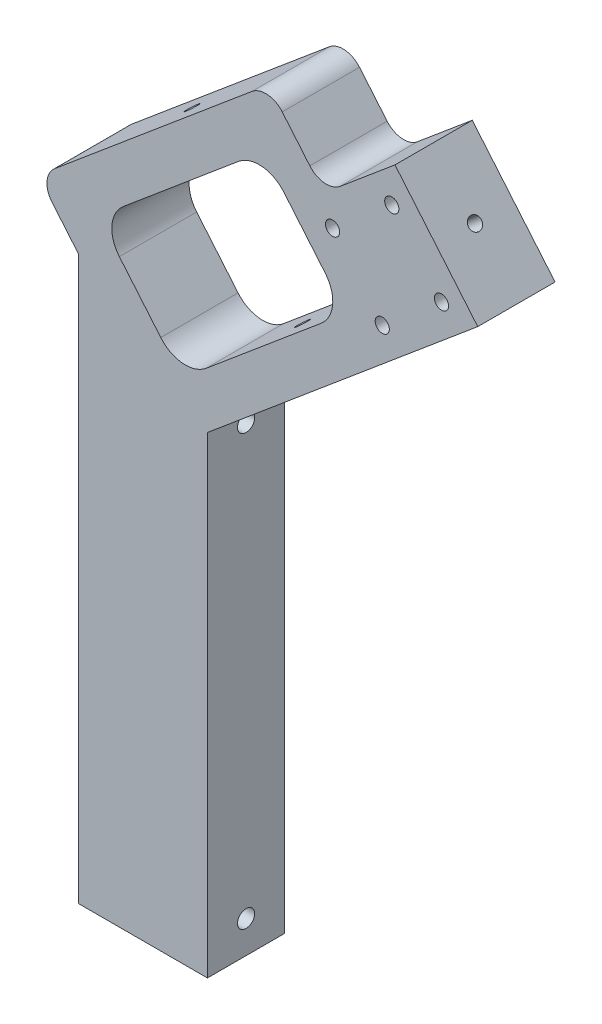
from build123d import *

# Parameters (mm, degrees)
ESQUISSE1_R                  = 3.3
BOSS_EXTRU_1_DEPTH           = 18
ENL_V_MAT_EXTRU_1_DEPTH      = 265.286467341
ENL_V_MAT_EXTRU_1_DEPTH_BACK = 265.286467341
ESQUISSE2_R                  = 4
ENL_V_MAT_EXTRU_2_DEPTH      = 271.104745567
ENL_V_MAT_EXTRU_2_DEPTH_BACK = 271.104745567
ESQUISSE3_R                  = 3
ESQUISSE4_R                  = 3
ENL_V_MAT_EXTRU_3_DEPTH      = 100


with BuildPart() as part:
    # Esquisse1 → Boss.-Extru.1 (new, symmetric)
    with BuildSketch(Plane.XY):
        with BuildLine():
            Line((-74.959861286, -139.936063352), (-74.959861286, 122.010399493))
            Line((-74.959861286, 122.010399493), (-87.365590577, 136.794971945))
            ThreePointArc((-87.365590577, 136.794971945), (-89.667093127, 144.094405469), (-86.133022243, 150.883292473))
            Line((-86.133022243, 150.883292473), (5.792310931, 228.017805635))
            ThreePointArc((5.792310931, 228.017805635), (13.091744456, 230.319308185), (19.880631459, 226.785237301))
            Line((19.880631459, 226.785237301), (32.736383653, 211.464348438))
            ThreePointArc((32.736383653, 211.464348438), (39.525270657, 207.930277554), (46.824704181, 210.231780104))
            Line((46.824704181, 210.231780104), (72.375827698, 231.671718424))
            Line((72.375827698, 231.671718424), (110.94308428, 185.709051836))
            Line((110.94308428, 185.709051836), (-14.959861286, 80.063936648))
            Line((-14.959861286, 80.063936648), (-14.959861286, -139.936063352))
            Line((-14.959861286, -139.936063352), (-74.959861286, -139.936063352))
        make_face()
        with Locations((43.319145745, 191.625379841)):
            Circle(ESQUISSE1_R, mode=Mode.SUBTRACT)
        with Locations((70.896745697, 214.76573379)):
            Circle(ESQUISSE1_R, mode=Mode.SUBTRACT)
        with Locations((94.037099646, 187.188133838)):
            Circle(ESQUISSE1_R, mode=Mode.SUBTRACT)
        with Locations((66.459499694, 164.047779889)):
            Circle(ESQUISSE1_R, mode=Mode.SUBTRACT)
        with BuildLine():
            Line((-15.55890239, 105.669427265), (38.064208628, 150.664559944))
            ThreePointArc((38.064208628, 150.664559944), (43.365314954, 160.847890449), (39.91306113, 171.797040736))
            Line((39.91306113, 171.797040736), (20.629432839, 194.778374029))
            ThreePointArc((20.629432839, 194.778374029), (10.446102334, 200.079480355), (-0.503047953, 196.627226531))
            Line((-0.503047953, 196.627226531), (-54.126158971, 151.632093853))
            ThreePointArc((-54.126158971, 151.632093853), (-59.427265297, 141.448763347), (-55.975011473, 130.499613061))
            Line((-55.975011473, 130.499613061), (-36.691383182, 107.518279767))
            ThreePointArc((-36.691383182, 107.518279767), (-26.508052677, 102.217173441), (-15.55890239, 105.669427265))
        make_face(mode=Mode.SUBTRACT)
    extrude(amount=BOSS_EXTRU_1_DEPTH, both=True)

    # Esquisse2 → Enl_v. mat.-Extru.1 (cut, two sides: drawn at the far end of the back side and taken through both)
    with BuildSketch(Plane(origin=(-14.959861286, 0, 0), x_dir=(0, 0, -1), z_dir=(1, 0, 0)).offset(-ENL_V_MAT_EXTRU_1_DEPTH_BACK)):
        with Locations((0, -124.936063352)):
            Circle(ESQUISSE2_R)
        with Locations((0, 75.063936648)):
            Circle(ESQUISSE2_R)
    extrude(amount=ENL_V_MAT_EXTRU_1_DEPTH + ENL_V_MAT_EXTRU_1_DEPTH_BACK, mode=Mode.SUBTRACT)

    # Esquisse3 → Enl_v. mat.-Extru.2 (cut, two sides: drawn at the far end of the back side and taken through both)
    with BuildSketch(Plane(origin=(-58.460599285, 69.670629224, 0), x_dir=(0, 0, 1), z_dir=(-0.642787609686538, 0.7660444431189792, 0)).offset(-ENL_V_MAT_EXTRU_2_DEPTH_BACK)):
        with Locations(Location((0, 91.004187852, 0), (0, 0, 90))):
            Circle(ESQUISSE3_R)
    extrude(amount=ENL_V_MAT_EXTRU_2_DEPTH + ENL_V_MAT_EXTRU_2_DEPTH_BACK, mode=Mode.SUBTRACT)

    # Esquisse4 → Enl_v. mat.-Extru.3 (cut)
    with BuildSketch(Plane(origin=(156.547931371, 131.359311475, 0), x_dir=(0.6427876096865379, -0.7660444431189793, 0), z_dir=(0.7660444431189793, 0.6427876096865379, 0))):
        with Locations(Location((-100.948547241, 0, 0), (0, 0, 180))):
            Circle(ESQUISSE4_R)
    extrude(amount=-ENL_V_MAT_EXTRU_3_DEPTH, mode=Mode.SUBTRACT)


solid = part.part
